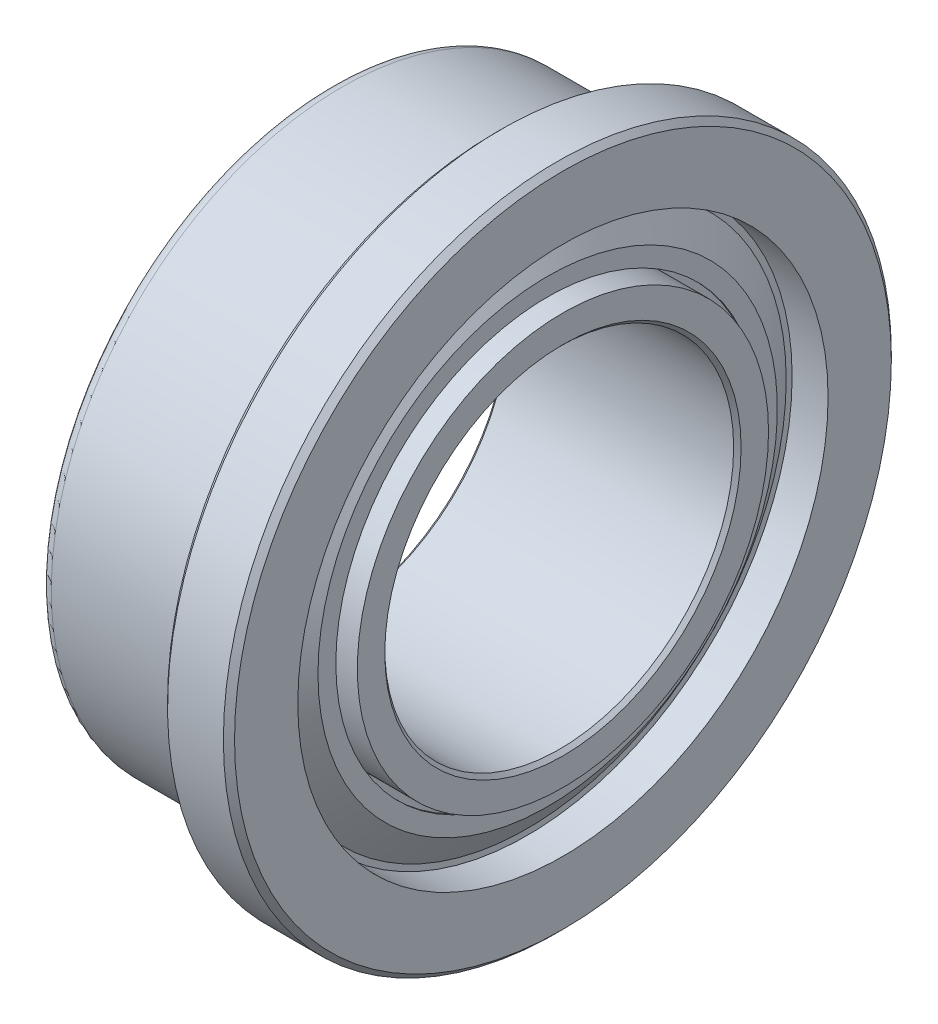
ISO-10303-21;
HEADER;
FILE_DESCRIPTION(('STEP AP214'),'2;1');
FILE_NAME('part.step','',(''),(''),'','','');
FILE_SCHEMA(('AUTOMOTIVE_DESIGN { 1 0 10303 214 1 1 1 1 }'));
ENDSEC;
DATA;
#1=APPLICATION_CONTEXT('core data for automotive mechanical design processes');
#2=APPLICATION_PROTOCOL_DEFINITION('international standard','automotive_design',2000,#1);
#3=PRODUCT_CONTEXT('',#1,'mechanical');
#4=PRODUCT('Part','Part','',(#3));
#5=PRODUCT_RELATED_PRODUCT_CATEGORY('part','',(#4));
#6=PRODUCT_DEFINITION_FORMATION('','',#4);
#7=PRODUCT_DEFINITION_CONTEXT('part definition',#1,'design');
#8=PRODUCT_DEFINITION('design','',#6,#7);
#9=PRODUCT_DEFINITION_SHAPE('','',#8);
#10=(LENGTH_UNIT() NAMED_UNIT(*) SI_UNIT(.MILLI.,.METRE.));
#11=(NAMED_UNIT(*) PLANE_ANGLE_UNIT() SI_UNIT($,.RADIAN.));
#12=(NAMED_UNIT(*) SI_UNIT($,.STERADIAN.) SOLID_ANGLE_UNIT());
#13=UNCERTAINTY_MEASURE_WITH_UNIT(LENGTH_MEASURE(1.E-05),#10,'distance_accuracy_value','');
#14=(GEOMETRIC_REPRESENTATION_CONTEXT(3) GLOBAL_UNCERTAINTY_ASSIGNED_CONTEXT((#13)) GLOBAL_UNIT_ASSIGNED_CONTEXT((#10,
#11,#12)) REPRESENTATION_CONTEXT('',''));
#15=CARTESIAN_POINT('',(0.,0.,0.));
#16=DIRECTION('',(0.,0.,1.));
#17=DIRECTION('',(1.,0.,0.));
#18=AXIS2_PLACEMENT_3D('',#15,#16,#17);
#19=CARTESIAN_POINT('',(1.58750000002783,0.,0.));
#20=DIRECTION('',(1.,0.,0.));
#21=DIRECTION('',(0.,0.,-1.));
#22=AXIS2_PLACEMENT_3D('',#19,#20,#21);
#23=CONICAL_SURFACE('',#22,2.43205000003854,0.785398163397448);
#24=CARTESIAN_POINT('',(1.58750000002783,0.,0.));
#25=DIRECTION('',(1.,0.,0.));
#26=DIRECTION('',(0.,0.,-1.));
#27=AXIS2_PLACEMENT_3D('',#24,#25,#26);
#28=CIRCLE('',#27,2.43205000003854);
#29=CARTESIAN_POINT('',(1.58750000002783,0.,-2.43205000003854));
#30=VERTEX_POINT('',#29);
#31=EDGE_CURVE('E47',#30,#30,#28,.F.);
#32=ORIENTED_EDGE('',*,*,#31,.F.);
#33=EDGE_LOOP('',(#32));
#34=FACE_BOUND('',#33,.T.);
#35=CARTESIAN_POINT('',(1.5367,0.,0.));
#36=DIRECTION('',(1.,0.,0.));
#37=DIRECTION('',(0.,0.,-1.));
#38=AXIS2_PLACEMENT_3D('',#35,#36,#37);
#39=CIRCLE('',#38,2.38125);
#40=CARTESIAN_POINT('',(1.5367,0.,-2.38125));
#41=VERTEX_POINT('',#40);
#42=EDGE_CURVE('E50',#41,#41,#39,.F.);
#43=ORIENTED_EDGE('',*,*,#42,.T.);
#44=EDGE_LOOP('',(#43));
#45=FACE_BOUND('',#44,.T.);
#46=ADVANCED_FACE('F16',(#34,#45),#23,.F.);
#47=CARTESIAN_POINT('',(1.5875,0.,0.));
#48=DIRECTION('',(1.,0.,0.));
#49=DIRECTION('',(0.,0.,-1.));
#50=AXIS2_PLACEMENT_3D('',#47,#48,#49);
#51=PLANE('',#50);
#52=ORIENTED_EDGE('',*,*,#31,.T.);
#53=EDGE_LOOP('',(#52));
#54=FACE_BOUND('',#53,.T.);
#55=CARTESIAN_POINT('',(1.5875,0.,0.));
#56=DIRECTION('',(1.,0.,0.));
#57=DIRECTION('',(0.,0.,-1.));
#58=AXIS2_PLACEMENT_3D('',#55,#56,#57);
#59=CIRCLE('',#58,2.8067);
#60=CARTESIAN_POINT('',(1.5875,0.,-2.8067));
#61=VERTEX_POINT('',#60);
#62=EDGE_CURVE('E51',#61,#61,#59,.F.);
#63=ORIENTED_EDGE('',*,*,#62,.F.);
#64=EDGE_LOOP('',(#63));
#65=FACE_BOUND('',#64,.T.);
#66=ADVANCED_FACE('F290',(#54,#65),#51,.T.);
#67=CARTESIAN_POINT('',(-1.74625,0.,0.));
#68=DIRECTION('',(1.,0.,0.));
#69=DIRECTION('',(0.,0.,-1.));
#70=AXIS2_PLACEMENT_3D('',#67,#68,#69);
#71=CYLINDRICAL_SURFACE('',#70,2.38125);
#72=ORIENTED_EDGE('',*,*,#42,.F.);
#73=EDGE_LOOP('',(#72));
#74=FACE_BOUND('',#73,.T.);
#75=CARTESIAN_POINT('',(-1.53669999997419,0.,0.));
#76=DIRECTION('',(-1.,0.,0.));
#77=DIRECTION('',(0.,1.,0.));
#78=AXIS2_PLACEMENT_3D('',#75,#76,#77);
#79=CIRCLE('',#78,2.3812499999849);
#80=CARTESIAN_POINT('',(-1.53669999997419,2.3812499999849,0.));
#81=VERTEX_POINT('',#80);
#82=EDGE_CURVE('E54',#81,#81,#79,.T.);
#83=ORIENTED_EDGE('',*,*,#82,.T.);
#84=EDGE_LOOP('',(#83));
#85=FACE_BOUND('',#84,.T.);
#86=ADVANCED_FACE('F287',(#74,#85),#71,.F.);
#87=CARTESIAN_POINT('',(-1.74625,0.,0.));
#88=DIRECTION('',(1.,0.,0.));
#89=DIRECTION('',(0.,0.,-1.));
#90=AXIS2_PLACEMENT_3D('',#87,#88,#89);
#91=CYLINDRICAL_SURFACE('',#90,2.8067);
#92=CARTESIAN_POINT('',(0.79375,0.,0.));
#93=DIRECTION('',(1.,0.,0.));
#94=DIRECTION('',(0.,0.,-1.));
#95=AXIS2_PLACEMENT_3D('',#92,#93,#94);
#96=CIRCLE('',#95,2.8067);
#97=CARTESIAN_POINT('',(0.79375,0.,-2.8067));
#98=VERTEX_POINT('',#97);
#99=EDGE_CURVE('E55',#98,#98,#96,.F.);
#100=ORIENTED_EDGE('',*,*,#99,.F.);
#101=EDGE_LOOP('',(#100));
#102=FACE_BOUND('',#101,.T.);
#103=ORIENTED_EDGE('',*,*,#62,.T.);
#104=EDGE_LOOP('',(#103));
#105=FACE_BOUND('',#104,.T.);
#106=ADVANCED_FACE('F283',(#102,#105),#91,.T.);
#107=CARTESIAN_POINT('',(-1.58750000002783,0.,0.));
#108=DIRECTION('',(-1.,0.,0.));
#109=DIRECTION('',(0.,0.,1.));
#110=AXIS2_PLACEMENT_3D('',#107,#108,#109);
#111=CONICAL_SURFACE('',#110,2.43205000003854,0.785398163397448);
#112=ORIENTED_EDGE('',*,*,#82,.F.);
#113=EDGE_LOOP('',(#112));
#114=FACE_BOUND('',#113,.T.);
#115=CARTESIAN_POINT('',(-1.58750000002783,0.,0.));
#116=DIRECTION('',(-1.,0.,0.));
#117=DIRECTION('',(0.,0.,1.));
#118=AXIS2_PLACEMENT_3D('',#115,#116,#117);
#119=CIRCLE('',#118,2.43205000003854);
#120=CARTESIAN_POINT('',(-1.58750000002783,0.,2.43205000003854));
#121=VERTEX_POINT('',#120);
#122=EDGE_CURVE('E58',#121,#121,#119,.T.);
#123=ORIENTED_EDGE('',*,*,#122,.T.);
#124=EDGE_LOOP('',(#123));
#125=FACE_BOUND('',#124,.T.);
#126=ADVANCED_FACE('F279',(#114,#125),#111,.F.);
#127=CARTESIAN_POINT('',(0.79375,0.,0.));
#128=DIRECTION('',(1.,0.,0.));
#129=DIRECTION('',(0.,0.,-1.));
#130=AXIS2_PLACEMENT_3D('',#127,#128,#129);
#131=PLANE('',#130);
#132=ORIENTED_EDGE('',*,*,#99,.T.);
#133=EDGE_LOOP('',(#132));
#134=FACE_BOUND('',#133,.T.);
#135=CARTESIAN_POINT('',(0.79375,0.,0.));
#136=DIRECTION('',(1.,0.,0.));
#137=DIRECTION('',(0.,0.,-1.));
#138=AXIS2_PLACEMENT_3D('',#135,#136,#137);
#139=CIRCLE('',#138,3.6195);
#140=CARTESIAN_POINT('',(0.79375,0.,-3.6195));
#141=VERTEX_POINT('',#140);
#142=EDGE_CURVE('E61',#141,#141,#139,.T.);
#143=ORIENTED_EDGE('',*,*,#142,.T.);
#144=EDGE_LOOP('',(#143));
#145=FACE_BOUND('',#144,.T.);
#146=ADVANCED_FACE('F275',(#134,#145),#131,.T.);
#147=CARTESIAN_POINT('',(-1.5875,0.,0.));
#148=DIRECTION('',(1.,0.,0.));
#149=DIRECTION('',(0.,0.,-1.));
#150=AXIS2_PLACEMENT_3D('',#147,#148,#149);
#151=PLANE('',#150);
#152=ORIENTED_EDGE('',*,*,#122,.F.);
#153=EDGE_LOOP('',(#152));
#154=FACE_BOUND('',#153,.T.);
#155=CARTESIAN_POINT('',(-1.5875,0.,0.));
#156=DIRECTION('',(1.,0.,0.));
#157=DIRECTION('',(0.,0.,-1.));
#158=AXIS2_PLACEMENT_3D('',#155,#156,#157);
#159=CIRCLE('',#158,2.8067);
#160=CARTESIAN_POINT('',(-1.5875,0.,-2.8067));
#161=VERTEX_POINT('',#160);
#162=EDGE_CURVE('E64',#161,#161,#159,.T.);
#163=ORIENTED_EDGE('',*,*,#162,.F.);
#164=EDGE_LOOP('',(#163));
#165=FACE_BOUND('',#164,.T.);
#166=ADVANCED_FACE('F271',(#154,#165),#151,.F.);
#167=CARTESIAN_POINT('',(-1.74625,0.,0.));
#168=DIRECTION('',(1.,0.,0.));
#169=DIRECTION('',(0.,0.,-1.));
#170=AXIS2_PLACEMENT_3D('',#167,#168,#169);
#171=CYLINDRICAL_SURFACE('',#170,3.6195);
#172=ORIENTED_EDGE('',*,*,#142,.F.);
#173=EDGE_LOOP('',(#172));
#174=FACE_BOUND('',#173,.T.);
#175=CARTESIAN_POINT('',(1.0715625,0.,0.));
#176=DIRECTION('',(1.,0.,0.));
#177=DIRECTION('',(0.,0.,-1.));
#178=AXIS2_PLACEMENT_3D('',#175,#176,#177);
#179=CIRCLE('',#178,3.6195);
#180=CARTESIAN_POINT('',(1.0715625,0.,-3.6195));
#181=VERTEX_POINT('',#180);
#182=EDGE_CURVE('E67',#181,#181,#179,.T.);
#183=ORIENTED_EDGE('',*,*,#182,.T.);
#184=EDGE_LOOP('',(#183));
#185=FACE_BOUND('',#184,.T.);
#186=ADVANCED_FACE('F267',(#174,#185),#171,.F.);
#187=CARTESIAN_POINT('',(-1.74625,0.,0.));
#188=DIRECTION('',(1.,0.,0.));
#189=DIRECTION('',(0.,0.,-1.));
#190=AXIS2_PLACEMENT_3D('',#187,#188,#189);
#191=CYLINDRICAL_SURFACE('',#190,2.8067);
#192=ORIENTED_EDGE('',*,*,#162,.T.);
#193=EDGE_LOOP('',(#192));
#194=FACE_BOUND('',#193,.T.);
#195=CARTESIAN_POINT('',(-0.79375,0.,0.));
#196=DIRECTION('',(1.,0.,0.));
#197=DIRECTION('',(0.,0.,-1.));
#198=AXIS2_PLACEMENT_3D('',#195,#196,#197);
#199=CIRCLE('',#198,2.8067);
#200=CARTESIAN_POINT('',(-0.79375,0.,-2.8067));
#201=VERTEX_POINT('',#200);
#202=EDGE_CURVE('E70',#201,#201,#199,.F.);
#203=ORIENTED_EDGE('',*,*,#202,.T.);
#204=EDGE_LOOP('',(#203));
#205=FACE_BOUND('',#204,.T.);
#206=ADVANCED_FACE('F263',(#194,#205),#191,.T.);
#207=CARTESIAN_POINT('',(1.0715625,0.,0.));
#208=DIRECTION('',(1.,0.,0.));
#209=DIRECTION('',(0.,0.,-1.));
#210=AXIS2_PLACEMENT_3D('',#207,#208,#209);
#211=PLANE('',#210);
#212=CARTESIAN_POINT('',(1.0715624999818,0.,0.));
#213=DIRECTION('',(-1.,0.,0.));
#214=DIRECTION('',(0.,0.,1.));
#215=AXIS2_PLACEMENT_3D('',#212,#213,#214);
#216=CIRCLE('',#215,3.53021141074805);
#217=CARTESIAN_POINT('',(1.0715624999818,0.,3.53021141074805));
#218=VERTEX_POINT('',#217);
#219=EDGE_CURVE('E73',#218,#218,#216,.F.);
#220=ORIENTED_EDGE('',*,*,#219,.T.);
#221=EDGE_LOOP('',(#220));
#222=FACE_BOUND('',#221,.T.);
#223=ORIENTED_EDGE('',*,*,#182,.F.);
#224=EDGE_LOOP('',(#223));
#225=FACE_BOUND('',#224,.T.);
#226=ADVANCED_FACE('F259',(#222,#225),#211,.F.);
#227=CARTESIAN_POINT('',(-0.79375,0.,0.));
#228=DIRECTION('',(1.,0.,0.));
#229=DIRECTION('',(0.,0.,-1.));
#230=AXIS2_PLACEMENT_3D('',#227,#228,#229);
#231=PLANE('',#230);
#232=ORIENTED_EDGE('',*,*,#202,.F.);
#233=EDGE_LOOP('',(#232));
#234=FACE_BOUND('',#233,.T.);
#235=CARTESIAN_POINT('',(-0.79375,0.,0.));
#236=DIRECTION('',(1.,0.,0.));
#237=DIRECTION('',(0.,0.,-1.));
#238=AXIS2_PLACEMENT_3D('',#235,#236,#237);
#239=CIRCLE('',#238,3.6195);
#240=CARTESIAN_POINT('',(-0.79375,0.,-3.6195));
#241=VERTEX_POINT('',#240);
#242=EDGE_CURVE('E76',#241,#241,#239,.F.);
#243=ORIENTED_EDGE('',*,*,#242,.T.);
#244=EDGE_LOOP('',(#243));
#245=FACE_BOUND('',#244,.T.);
#246=ADVANCED_FACE('F255',(#234,#245),#231,.F.);
#247=CARTESIAN_POINT('',(1.07156250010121,0.,0.));
#248=DIRECTION('',(-1.,0.,0.));
#249=DIRECTION('',(0.,0.,1.));
#250=AXIS2_PLACEMENT_3D('',#247,#248,#249);
#251=CONICAL_SURFACE('',#250,3.53021141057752,0.959931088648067);
#252=ORIENTED_EDGE('',*,*,#219,.F.);
#253=EDGE_LOOP('',(#252));
#254=FACE_BOUND('',#253,.T.);
#255=CARTESIAN_POINT('',(1.35345905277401,0.,0.));
#256=DIRECTION('',(-1.,0.,0.));
#257=DIRECTION('',(0.,0.,1.));
#258=AXIS2_PLACEMENT_3D('',#255,#256,#257);
#259=CIRCLE('',#258,3.12762141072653);
#260=CARTESIAN_POINT('',(1.35345905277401,0.,3.12762141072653));
#261=VERTEX_POINT('',#260);
#262=EDGE_CURVE('E79',#261,#261,#259,.F.);
#263=ORIENTED_EDGE('',*,*,#262,.T.);
#264=EDGE_LOOP('',(#263));
#265=FACE_BOUND('',#264,.T.);
#266=ADVANCED_FACE('F251',(#254,#265),#251,.F.);
#267=CARTESIAN_POINT('',(-1.74625,0.,0.));
#268=DIRECTION('',(1.,0.,0.));
#269=DIRECTION('',(0.,0.,-1.));
#270=AXIS2_PLACEMENT_3D('',#267,#268,#269);
#271=CYLINDRICAL_SURFACE('',#270,3.6195);
#272=ORIENTED_EDGE('',*,*,#242,.F.);
#273=EDGE_LOOP('',(#272));
#274=FACE_BOUND('',#273,.T.);
#275=CARTESIAN_POINT('',(-1.0715625,0.,0.));
#276=DIRECTION('',(1.,0.,0.));
#277=DIRECTION('',(0.,0.,-1.));
#278=AXIS2_PLACEMENT_3D('',#275,#276,#277);
#279=CIRCLE('',#278,3.6195);
#280=CARTESIAN_POINT('',(-1.0715625,0.,-3.6195));
#281=VERTEX_POINT('',#280);
#282=EDGE_CURVE('E82',#281,#281,#279,.T.);
#283=ORIENTED_EDGE('',*,*,#282,.F.);
#284=EDGE_LOOP('',(#283));
#285=FACE_BOUND('',#284,.T.);
#286=ADVANCED_FACE('F247',(#274,#285),#271,.F.);
#287=CARTESIAN_POINT('',(1.35345905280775,0.,0.));
#288=DIRECTION('',(1.,0.,0.));
#289=DIRECTION('',(0.,0.,-1.));
#290=AXIS2_PLACEMENT_3D('',#287,#288,#289);
#291=PLANE('',#290);
#292=CARTESIAN_POINT('',(1.35345905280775,0.,0.));
#293=DIRECTION('',(1.,0.,0.));
#294=DIRECTION('',(0.,0.,-1.));
#295=AXIS2_PLACEMENT_3D('',#292,#293,#294);
#296=CIRCLE('',#295,2.89179);
#297=CARTESIAN_POINT('',(1.35345905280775,0.,-2.89179));
#298=VERTEX_POINT('',#297);
#299=EDGE_CURVE('E85',#298,#298,#296,.T.);
#300=ORIENTED_EDGE('',*,*,#299,.T.);
#301=EDGE_LOOP('',(#300));
#302=FACE_BOUND('',#301,.T.);
#303=ORIENTED_EDGE('',*,*,#262,.F.);
#304=EDGE_LOOP('',(#303));
#305=FACE_BOUND('',#304,.T.);
#306=ADVANCED_FACE('F243',(#302,#305),#291,.F.);
#307=CARTESIAN_POINT('',(-1.0715625,0.,0.));
#308=DIRECTION('',(1.,0.,0.));
#309=DIRECTION('',(0.,0.,-1.));
#310=AXIS2_PLACEMENT_3D('',#307,#308,#309);
#311=PLANE('',#310);
#312=CARTESIAN_POINT('',(-1.0715624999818,0.,0.));
#313=DIRECTION('',(1.,0.,0.));
#314=DIRECTION('',(0.,0.,-1.));
#315=AXIS2_PLACEMENT_3D('',#312,#313,#314);
#316=CIRCLE('',#315,3.53021141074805);
#317=CARTESIAN_POINT('',(-1.0715624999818,0.,-3.53021141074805));
#318=VERTEX_POINT('',#317);
#319=EDGE_CURVE('E88',#318,#318,#316,.F.);
#320=ORIENTED_EDGE('',*,*,#319,.T.);
#321=EDGE_LOOP('',(#320));
#322=FACE_BOUND('',#321,.T.);
#323=ORIENTED_EDGE('',*,*,#282,.T.);
#324=EDGE_LOOP('',(#323));
#325=FACE_BOUND('',#324,.T.);
#326=ADVANCED_FACE('F239',(#322,#325),#311,.T.);
#327=CARTESIAN_POINT('',(1.05619767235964,0.,0.));
#328=DIRECTION('',(1.,0.,0.));
#329=DIRECTION('',(0.,0.,-1.));
#330=AXIS2_PLACEMENT_3D('',#327,#328,#329);
#331=CYLINDRICAL_SURFACE('',#330,2.89179);
#332=CARTESIAN_POINT('',(1.37885905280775,0.,0.));
#333=DIRECTION('',(1.,0.,0.));
#334=DIRECTION('',(0.,0.,-1.));
#335=AXIS2_PLACEMENT_3D('',#332,#333,#334);
#336=CIRCLE('',#335,2.89179);
#337=CARTESIAN_POINT('',(1.37885905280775,0.,-2.89179));
#338=VERTEX_POINT('',#337);
#339=EDGE_CURVE('E91',#338,#338,#336,.F.);
#340=ORIENTED_EDGE('',*,*,#339,.F.);
#341=EDGE_LOOP('',(#340));
#342=FACE_BOUND('',#341,.T.);
#343=ORIENTED_EDGE('',*,*,#299,.F.);
#344=EDGE_LOOP('',(#343));
#345=FACE_BOUND('',#344,.T.);
#346=ADVANCED_FACE('F235',(#342,#345),#331,.F.);
#347=CARTESIAN_POINT('',(-1.07156250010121,0.,0.));
#348=DIRECTION('',(1.,0.,0.));
#349=DIRECTION('',(0.,0.,-1.));
#350=AXIS2_PLACEMENT_3D('',#347,#348,#349);
#351=CONICAL_SURFACE('',#350,3.53021141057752,0.959931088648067);
#352=ORIENTED_EDGE('',*,*,#319,.F.);
#353=EDGE_LOOP('',(#352));
#354=FACE_BOUND('',#353,.T.);
#355=CARTESIAN_POINT('',(-1.35345905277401,0.,0.));
#356=DIRECTION('',(1.,0.,0.));
#357=DIRECTION('',(0.,0.,-1.));
#358=AXIS2_PLACEMENT_3D('',#355,#356,#357);
#359=CIRCLE('',#358,3.12762141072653);
#360=CARTESIAN_POINT('',(-1.35345905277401,0.,-3.12762141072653));
#361=VERTEX_POINT('',#360);
#362=EDGE_CURVE('E94',#361,#361,#359,.T.);
#363=ORIENTED_EDGE('',*,*,#362,.F.);
#364=EDGE_LOOP('',(#363));
#365=FACE_BOUND('',#364,.T.);
#366=ADVANCED_FACE('F231',(#354,#365),#351,.F.);
#367=CARTESIAN_POINT('',(1.37885905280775,0.,0.));
#368=DIRECTION('',(1.,0.,0.));
#369=DIRECTION('',(0.,0.,-1.));
#370=AXIS2_PLACEMENT_3D('',#367,#368,#369);
#371=PLANE('',#370);
#372=ORIENTED_EDGE('',*,*,#339,.T.);
#373=EDGE_LOOP('',(#372));
#374=FACE_BOUND('',#373,.T.);
#375=CARTESIAN_POINT('',(1.37885905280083,0.,0.));
#376=DIRECTION('',(-1.,0.,0.));
#377=DIRECTION('',(0.,0.,1.));
#378=AXIS2_PLACEMENT_3D('',#375,#376,#377);
#379=CIRCLE('',#378,3.1356299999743);
#380=CARTESIAN_POINT('',(1.37885905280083,0.,3.1356299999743));
#381=VERTEX_POINT('',#380);
#382=EDGE_CURVE('E97',#381,#381,#379,.T.);
#383=ORIENTED_EDGE('',*,*,#382,.F.);
#384=EDGE_LOOP('',(#383));
#385=FACE_BOUND('',#384,.T.);
#386=ADVANCED_FACE('F227',(#374,#385),#371,.T.);
#387=CARTESIAN_POINT('',(-1.35345905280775,0.,0.));
#388=DIRECTION('',(1.,0.,0.));
#389=DIRECTION('',(0.,0.,-1.));
#390=AXIS2_PLACEMENT_3D('',#387,#388,#389);
#391=PLANE('',#390);
#392=CARTESIAN_POINT('',(-1.35345905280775,0.,0.));
#393=DIRECTION('',(1.,0.,0.));
#394=DIRECTION('',(0.,0.,-1.));
#395=AXIS2_PLACEMENT_3D('',#392,#393,#394);
#396=CIRCLE('',#395,2.89179);
#397=CARTESIAN_POINT('',(-1.35345905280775,0.,-2.89179));
#398=VERTEX_POINT('',#397);
#399=EDGE_CURVE('E100',#398,#398,#396,.F.);
#400=ORIENTED_EDGE('',*,*,#399,.T.);
#401=EDGE_LOOP('',(#400));
#402=FACE_BOUND('',#401,.T.);
#403=ORIENTED_EDGE('',*,*,#362,.T.);
#404=EDGE_LOOP('',(#403));
#405=FACE_BOUND('',#404,.T.);
#406=ADVANCED_FACE('F223',(#402,#405),#391,.T.);
#407=CARTESIAN_POINT('',(1.09696250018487,0.,0.));
#408=DIRECTION('',(-1.,0.,0.));
#409=DIRECTION('',(0.,0.,1.));
#410=AXIS2_PLACEMENT_3D('',#407,#408,#409);
#411=CONICAL_SURFACE('',#410,3.5382199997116,0.95993108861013);
#412=CARTESIAN_POINT('',(1.09696249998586,0.,0.));
#413=DIRECTION('',(-1.,0.,0.));
#414=DIRECTION('',(0.,0.,1.));
#415=AXIS2_PLACEMENT_3D('',#412,#413,#414);
#416=CIRCLE('',#415,3.53821999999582);
#417=CARTESIAN_POINT('',(1.09696249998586,0.,3.53821999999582));
#418=VERTEX_POINT('',#417);
#419=EDGE_CURVE('E103',#418,#418,#416,.T.);
#420=ORIENTED_EDGE('',*,*,#419,.F.);
#421=EDGE_LOOP('',(#420));
#422=FACE_BOUND('',#421,.T.);
#423=ORIENTED_EDGE('',*,*,#382,.T.);
#424=EDGE_LOOP('',(#423));
#425=FACE_BOUND('',#424,.T.);
#426=ADVANCED_FACE('F219',(#422,#425),#411,.T.);
#427=CARTESIAN_POINT('',(-1.05619767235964,0.,0.));
#428=DIRECTION('',(1.,0.,0.));
#429=DIRECTION('',(0.,0.,-1.));
#430=AXIS2_PLACEMENT_3D('',#427,#428,#429);
#431=CYLINDRICAL_SURFACE('',#430,2.89179);
#432=CARTESIAN_POINT('',(-1.37885905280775,0.,0.));
#433=DIRECTION('',(1.,0.,0.));
#434=DIRECTION('',(0.,0.,-1.));
#435=AXIS2_PLACEMENT_3D('',#432,#433,#434);
#436=CIRCLE('',#435,2.89179);
#437=CARTESIAN_POINT('',(-1.37885905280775,0.,-2.89179));
#438=VERTEX_POINT('',#437);
#439=EDGE_CURVE('E106',#438,#438,#436,.F.);
#440=ORIENTED_EDGE('',*,*,#439,.T.);
#441=EDGE_LOOP('',(#440));
#442=FACE_BOUND('',#441,.T.);
#443=ORIENTED_EDGE('',*,*,#399,.F.);
#444=EDGE_LOOP('',(#443));
#445=FACE_BOUND('',#444,.T.);
#446=ADVANCED_FACE('F215',(#442,#445),#431,.F.);
#447=CARTESIAN_POINT('',(1.0969625,0.,0.));
#448=DIRECTION('',(1.,0.,0.));
#449=DIRECTION('',(0.,0.,-1.));
#450=AXIS2_PLACEMENT_3D('',#447,#448,#449);
#451=PLANE('',#450);
#452=ORIENTED_EDGE('',*,*,#419,.T.);
#453=EDGE_LOOP('',(#452));
#454=FACE_BOUND('',#453,.T.);
#455=CARTESIAN_POINT('',(1.0969625,0.,0.));
#456=DIRECTION('',(1.,0.,0.));
#457=DIRECTION('',(0.,0.,-1.));
#458=AXIS2_PLACEMENT_3D('',#455,#456,#457);
#459=CIRCLE('',#458,3.6195);
#460=CARTESIAN_POINT('',(1.0969625,0.,-3.6195));
#461=VERTEX_POINT('',#460);
#462=EDGE_CURVE('E109',#461,#461,#459,.T.);
#463=ORIENTED_EDGE('',*,*,#462,.T.);
#464=EDGE_LOOP('',(#463));
#465=FACE_BOUND('',#464,.T.);
#466=ADVANCED_FACE('F211',(#454,#465),#451,.T.);
#467=CARTESIAN_POINT('',(-1.37885905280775,0.,0.));
#468=DIRECTION('',(1.,0.,0.));
#469=DIRECTION('',(0.,0.,-1.));
#470=AXIS2_PLACEMENT_3D('',#467,#468,#469);
#471=PLANE('',#470);
#472=ORIENTED_EDGE('',*,*,#439,.F.);
#473=EDGE_LOOP('',(#472));
#474=FACE_BOUND('',#473,.T.);
#475=CARTESIAN_POINT('',(-1.37885905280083,0.,0.));
#476=DIRECTION('',(1.,0.,0.));
#477=DIRECTION('',(0.,0.,-1.));
#478=AXIS2_PLACEMENT_3D('',#475,#476,#477);
#479=CIRCLE('',#478,3.1356299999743);
#480=CARTESIAN_POINT('',(-1.37885905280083,0.,-3.1356299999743));
#481=VERTEX_POINT('',#480);
#482=EDGE_CURVE('E112',#481,#481,#479,.T.);
#483=ORIENTED_EDGE('',*,*,#482,.F.);
#484=EDGE_LOOP('',(#483));
#485=FACE_BOUND('',#484,.T.);
#486=ADVANCED_FACE('F207',(#474,#485),#471,.F.);
#487=CARTESIAN_POINT('',(-1.74625,0.,0.));
#488=DIRECTION('',(1.,0.,0.));
#489=DIRECTION('',(0.,0.,-1.));
#490=AXIS2_PLACEMENT_3D('',#487,#488,#489);
#491=CYLINDRICAL_SURFACE('',#490,3.6195);
#492=CARTESIAN_POINT('',(1.5875,0.,0.));
#493=DIRECTION('',(1.,0.,0.));
#494=DIRECTION('',(0.,0.,-1.));
#495=AXIS2_PLACEMENT_3D('',#492,#493,#494);
#496=CIRCLE('',#495,3.6195);
#497=CARTESIAN_POINT('',(1.5875,0.,-3.6195));
#498=VERTEX_POINT('',#497);
#499=EDGE_CURVE('E115',#498,#498,#496,.F.);
#500=ORIENTED_EDGE('',*,*,#499,.F.);
#501=EDGE_LOOP('',(#500));
#502=FACE_BOUND('',#501,.T.);
#503=ORIENTED_EDGE('',*,*,#462,.F.);
#504=EDGE_LOOP('',(#503));
#505=FACE_BOUND('',#504,.T.);
#506=ADVANCED_FACE('F203',(#502,#505),#491,.F.);
#507=CARTESIAN_POINT('',(-1.09696250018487,0.,0.));
#508=DIRECTION('',(1.,0.,0.));
#509=DIRECTION('',(0.,0.,-1.));
#510=AXIS2_PLACEMENT_3D('',#507,#508,#509);
#511=CONICAL_SURFACE('',#510,3.5382199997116,0.95993108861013);
#512=CARTESIAN_POINT('',(-1.09696249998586,0.,0.));
#513=DIRECTION('',(1.,0.,0.));
#514=DIRECTION('',(0.,0.,-1.));
#515=AXIS2_PLACEMENT_3D('',#512,#513,#514);
#516=CIRCLE('',#515,3.53821999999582);
#517=CARTESIAN_POINT('',(-1.09696249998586,0.,-3.53821999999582));
#518=VERTEX_POINT('',#517);
#519=EDGE_CURVE('E118',#518,#518,#516,.F.);
#520=ORIENTED_EDGE('',*,*,#519,.T.);
#521=EDGE_LOOP('',(#520));
#522=FACE_BOUND('',#521,.T.);
#523=ORIENTED_EDGE('',*,*,#482,.T.);
#524=EDGE_LOOP('',(#523));
#525=FACE_BOUND('',#524,.T.);
#526=ADVANCED_FACE('F199',(#522,#525),#511,.T.);
#527=CARTESIAN_POINT('',(1.5875,0.,0.));
#528=DIRECTION('',(1.,0.,0.));
#529=DIRECTION('',(0.,0.,-1.));
#530=AXIS2_PLACEMENT_3D('',#527,#528,#529);
#531=PLANE('',#530);
#532=ORIENTED_EDGE('',*,*,#499,.T.);
#533=EDGE_LOOP('',(#532));
#534=FACE_BOUND('',#533,.T.);
#535=CARTESIAN_POINT('',(1.58749999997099,0.,0.));
#536=DIRECTION('',(-1.,0.,0.));
#537=DIRECTION('',(0.,0.,1.));
#538=AXIS2_PLACEMENT_3D('',#535,#536,#537);
#539=CIRCLE('',#538,4.48309999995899);
#540=CARTESIAN_POINT('',(1.58749999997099,0.,4.48309999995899));
#541=VERTEX_POINT('',#540);
#542=EDGE_CURVE('E121',#541,#541,#539,.T.);
#543=ORIENTED_EDGE('',*,*,#542,.F.);
#544=EDGE_LOOP('',(#543));
#545=FACE_BOUND('',#544,.T.);
#546=ADVANCED_FACE('F195',(#534,#545),#531,.T.);
#547=CARTESIAN_POINT('',(-1.0969625,0.,0.));
#548=DIRECTION('',(1.,0.,0.));
#549=DIRECTION('',(0.,0.,-1.));
#550=AXIS2_PLACEMENT_3D('',#547,#548,#549);
#551=PLANE('',#550);
#552=ORIENTED_EDGE('',*,*,#519,.F.);
#553=EDGE_LOOP('',(#552));
#554=FACE_BOUND('',#553,.T.);
#555=CARTESIAN_POINT('',(-1.0969625,0.,0.));
#556=DIRECTION('',(1.,0.,0.));
#557=DIRECTION('',(0.,0.,-1.));
#558=AXIS2_PLACEMENT_3D('',#555,#556,#557);
#559=CIRCLE('',#558,3.6195);
#560=CARTESIAN_POINT('',(-1.0969625,0.,-3.6195));
#561=VERTEX_POINT('',#560);
#562=EDGE_CURVE('E124',#561,#561,#559,.F.);
#563=ORIENTED_EDGE('',*,*,#562,.T.);
#564=EDGE_LOOP('',(#563));
#565=FACE_BOUND('',#564,.T.);
#566=ADVANCED_FACE('F191',(#554,#565),#551,.F.);
#567=CARTESIAN_POINT('',(1.51129999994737,0.,0.));
#568=DIRECTION('',(-1.,0.,0.));
#569=DIRECTION('',(0.,0.,1.));
#570=AXIS2_PLACEMENT_3D('',#567,#568,#569);
#571=CONICAL_SURFACE('',#570,4.55930000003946,0.785398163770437);
#572=ORIENTED_EDGE('',*,*,#542,.T.);
#573=EDGE_LOOP('',(#572));
#574=FACE_BOUND('',#573,.T.);
#575=CARTESIAN_POINT('',(1.5113,0.,0.));
#576=DIRECTION('',(1.,0.,0.));
#577=DIRECTION('',(0.,0.,-1.));
#578=AXIS2_PLACEMENT_3D('',#575,#576,#577);
#579=CIRCLE('',#578,4.5593);
#580=CARTESIAN_POINT('',(1.5113,0.,-4.5593));
#581=VERTEX_POINT('',#580);
#582=EDGE_CURVE('E127',#581,#581,#579,.F.);
#583=ORIENTED_EDGE('',*,*,#582,.F.);
#584=EDGE_LOOP('',(#583));
#585=FACE_BOUND('',#584,.T.);
#586=ADVANCED_FACE('F187',(#574,#585),#571,.T.);
#587=CARTESIAN_POINT('',(-1.74625,0.,0.));
#588=DIRECTION('',(1.,0.,0.));
#589=DIRECTION('',(0.,0.,-1.));
#590=AXIS2_PLACEMENT_3D('',#587,#588,#589);
#591=CYLINDRICAL_SURFACE('',#590,3.6195);
#592=CARTESIAN_POINT('',(-1.5875,0.,0.));
#593=DIRECTION('',(1.,0.,0.));
#594=DIRECTION('',(0.,0.,-1.));
#595=AXIS2_PLACEMENT_3D('',#592,#593,#594);
#596=CIRCLE('',#595,3.6195);
#597=CARTESIAN_POINT('',(-1.5875,0.,-3.6195));
#598=VERTEX_POINT('',#597);
#599=EDGE_CURVE('E128',#598,#598,#596,.F.);
#600=ORIENTED_EDGE('',*,*,#599,.T.);
#601=EDGE_LOOP('',(#600));
#602=FACE_BOUND('',#601,.T.);
#603=ORIENTED_EDGE('',*,*,#562,.F.);
#604=EDGE_LOOP('',(#603));
#605=FACE_BOUND('',#604,.T.);
#606=ADVANCED_FACE('F183',(#602,#605),#591,.F.);
#607=CARTESIAN_POINT('',(-1.74625,0.,0.));
#608=DIRECTION('',(1.,0.,0.));
#609=DIRECTION('',(0.,0.,-1.));
#610=AXIS2_PLACEMENT_3D('',#607,#608,#609);
#611=CYLINDRICAL_SURFACE('',#610,4.5593);
#612=ORIENTED_EDGE('',*,*,#582,.T.);
#613=EDGE_LOOP('',(#612));
#614=FACE_BOUND('',#613,.T.);
#615=CARTESIAN_POINT('',(0.749300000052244,0.,0.));
#616=DIRECTION('',(1.,0.,0.));
#617=DIRECTION('',(0.,-1.,0.));
#618=AXIS2_PLACEMENT_3D('',#615,#616,#617);
#619=CIRCLE('',#618,4.55930000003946);
#620=CARTESIAN_POINT('',(0.749300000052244,-4.55930000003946,0.));
#621=VERTEX_POINT('',#620);
#622=EDGE_CURVE('E45',#621,#621,#619,.F.);
#623=ORIENTED_EDGE('',*,*,#622,.F.);
#624=EDGE_LOOP('',(#623));
#625=FACE_BOUND('',#624,.T.);
#626=ADVANCED_FACE('F171',(#614,#625),#611,.T.);
#627=CARTESIAN_POINT('',(-1.5875,0.,0.));
#628=DIRECTION('',(1.,0.,0.));
#629=DIRECTION('',(0.,0.,-1.));
#630=AXIS2_PLACEMENT_3D('',#627,#628,#629);
#631=PLANE('',#630);
#632=ORIENTED_EDGE('',*,*,#599,.F.);
#633=EDGE_LOOP('',(#632));
#634=FACE_BOUND('',#633,.T.);
#635=CARTESIAN_POINT('',(-1.5875,0.,0.));
#636=DIRECTION('',(1.,0.,0.));
#637=DIRECTION('',(0.,-1.,0.));
#638=AXIS2_PLACEMENT_3D('',#635,#636,#637);
#639=CIRCLE('',#638,3.81);
#640=CARTESIAN_POINT('',(-1.5875,-3.81,0.));
#641=VERTEX_POINT('',#640);
#642=CARTESIAN_POINT('',(-1.5875,3.81,0.));
#643=VERTEX_POINT('',#642);
#644=EDGE_CURVE('E33',#641,#643,#639,.T.);
#645=ORIENTED_EDGE('',*,*,#644,.F.);
#646=CARTESIAN_POINT('',(-1.5875,0.,0.));
#647=DIRECTION('',(1.,0.,0.));
#648=DIRECTION('',(0.,1.,0.));
#649=AXIS2_PLACEMENT_3D('',#646,#647,#648);
#650=CIRCLE('',#649,3.81);
#651=EDGE_CURVE('E36',#643,#641,#650,.T.);
#652=ORIENTED_EDGE('',*,*,#651,.F.);
#653=EDGE_LOOP('',(#645,#652));
#654=FACE_BOUND('',#653,.T.);
#655=ADVANCED_FACE('F38',(#634,#654),#631,.F.);
#656=CARTESIAN_POINT('',(0.749300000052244,0.,0.));
#657=DIRECTION('',(1.,0.,0.));
#658=DIRECTION('',(0.,0.,-1.));
#659=AXIS2_PLACEMENT_3D('',#656,#657,#658);
#660=CONICAL_SURFACE('',#659,4.55930000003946,0.785398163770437);
#661=ORIENTED_EDGE('',*,*,#622,.T.);
#662=EDGE_LOOP('',(#661));
#663=FACE_BOUND('',#662,.T.);
#664=CARTESIAN_POINT('',(0.673100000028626,0.,0.));
#665=DIRECTION('',(1.,0.,0.));
#666=DIRECTION('',(0.,0.,-1.));
#667=AXIS2_PLACEMENT_3D('',#664,#665,#666);
#668=CIRCLE('',#667,4.48309999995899);
#669=CARTESIAN_POINT('',(0.673100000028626,0.,-4.48309999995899));
#670=VERTEX_POINT('',#669);
#671=EDGE_CURVE('E41',#670,#670,#668,.T.);
#672=ORIENTED_EDGE('',*,*,#671,.T.);
#673=EDGE_LOOP('',(#672));
#674=FACE_BOUND('',#673,.T.);
#675=ADVANCED_FACE('F154',(#663,#674),#660,.T.);
#676=CARTESIAN_POINT('',(-1.42875,0.,0.));
#677=DIRECTION('',(1.,0.,0.));
#678=DIRECTION('',(0.,-1.,0.));
#679=AXIS2_PLACEMENT_3D('',#676,#677,#678);
#680=TOROIDAL_SURFACE('',#679,3.81,0.15875);
#681=CARTESIAN_POINT('',(-1.42875,0.,0.));
#682=DIRECTION('',(1.,0.,0.));
#683=DIRECTION('',(0.,0.,-1.));
#684=AXIS2_PLACEMENT_3D('',#681,#682,#683);
#685=CIRCLE('',#684,3.96875);
#686=CARTESIAN_POINT('',(-1.42875,0.,-3.96875));
#687=VERTEX_POINT('',#686);
#688=EDGE_CURVE('E26',#687,#687,#685,.T.);
#689=ORIENTED_EDGE('',*,*,#688,.F.);
#690=EDGE_LOOP('',(#689));
#691=FACE_BOUND('',#690,.T.);
#692=ORIENTED_EDGE('',*,*,#651,.T.);
#693=ORIENTED_EDGE('',*,*,#644,.T.);
#694=EDGE_LOOP('',(#692,#693));
#695=FACE_BOUND('',#694,.T.);
#696=ADVANCED_FACE('F44',(#691,#695),#680,.T.);
#697=CARTESIAN_POINT('',(0.6731,0.,0.));
#698=DIRECTION('',(1.,0.,0.));
#699=DIRECTION('',(0.,0.,-1.));
#700=AXIS2_PLACEMENT_3D('',#697,#698,#699);
#701=PLANE('',#700);
#702=CARTESIAN_POINT('',(0.6731,0.,0.));
#703=DIRECTION('',(1.,0.,0.));
#704=DIRECTION('',(0.,0.,-1.));
#705=AXIS2_PLACEMENT_3D('',#702,#703,#704);
#706=CIRCLE('',#705,3.96875);
#707=CARTESIAN_POINT('',(0.6731,0.,-3.96875));
#708=VERTEX_POINT('',#707);
#709=EDGE_CURVE('E11',#708,#708,#706,.F.);
#710=ORIENTED_EDGE('',*,*,#709,.F.);
#711=EDGE_LOOP('',(#710));
#712=FACE_BOUND('',#711,.T.);
#713=ORIENTED_EDGE('',*,*,#671,.F.);
#714=EDGE_LOOP('',(#713));
#715=FACE_BOUND('',#714,.T.);
#716=ADVANCED_FACE('F153',(#712,#715),#701,.F.);
#717=CARTESIAN_POINT('',(-1.74625,0.,0.));
#718=DIRECTION('',(1.,0.,0.));
#719=DIRECTION('',(0.,0.,-1.));
#720=AXIS2_PLACEMENT_3D('',#717,#718,#719);
#721=CYLINDRICAL_SURFACE('',#720,3.96875);
#722=ORIENTED_EDGE('',*,*,#709,.T.);
#723=EDGE_LOOP('',(#722));
#724=FACE_BOUND('',#723,.T.);
#725=ORIENTED_EDGE('',*,*,#688,.T.);
#726=EDGE_LOOP('',(#725));
#727=FACE_BOUND('',#726,.T.);
#728=ADVANCED_FACE('F300',(#724,#727),#721,.T.);
#729=CLOSED_SHELL('',(#46,#66,#86,#106,#126,#146,#166,#186,#206,#226,#246,#266,#286,#306,#326,
#346,#366,#386,#406,#426,#446,#466,#486,#506,#526,#546,#566,#586,#606,#626,#655,#675,#696,#716,#728));
#730=MANIFOLD_SOLID_BREP('B1',#729);
#731=ADVANCED_BREP_SHAPE_REPRESENTATION('',(#18,#730),#14);
#732=SHAPE_DEFINITION_REPRESENTATION(#9,#731);
ENDSEC;
END-ISO-10303-21;
